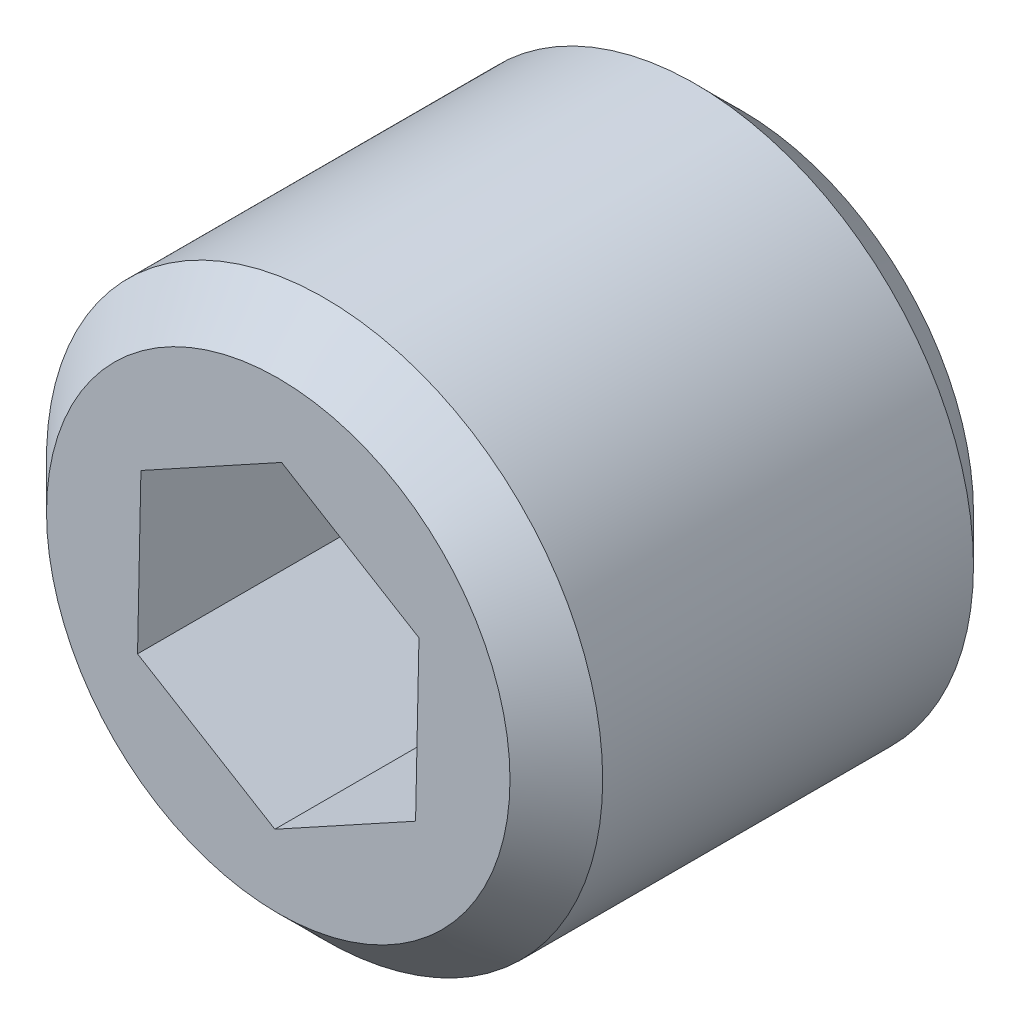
from build123d import *

# Parameters (mm, degrees)
CROQUIS1_R              = 6
SALIENTE_EXTRUIR1_DEPTH = 10
CORTAR_EXTRUIR1_DEPTH   = 5
CHAFL_N1_SIZE           = 1


with BuildPart() as part:
    # Croquis1 → Saliente-Extruir1 (new body)
    with BuildSketch(Plane.XY):
        Circle(CROQUIS1_R)
    extrude(amount=SALIENTE_EXTRUIR1_DEPTH)

    # Croquis2 → Cortar-Extruir1 (cut)
    with BuildSketch(Plane.XY.offset(10)):
        Polygon((-2.962761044, 1.795006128), (-3.035901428, -1.668323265), (-0.073140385, -3.463329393), (2.962761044, -1.795006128), (3.035901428, 1.668323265), (0.073140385, 3.463329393), align=None)
    extrude(amount=-CORTAR_EXTRUIR1_DEPTH, mode=Mode.SUBTRACT)

    # Chafl_n1
    chafl_n1_edges = [part.edges().sort_by_distance(p)[0] for p in [
        (-6, 0, 0),
        (-6, 0, 10),
    ]]
    chamfer(chafl_n1_edges, length=CHAFL_N1_SIZE)


solid = part.part
